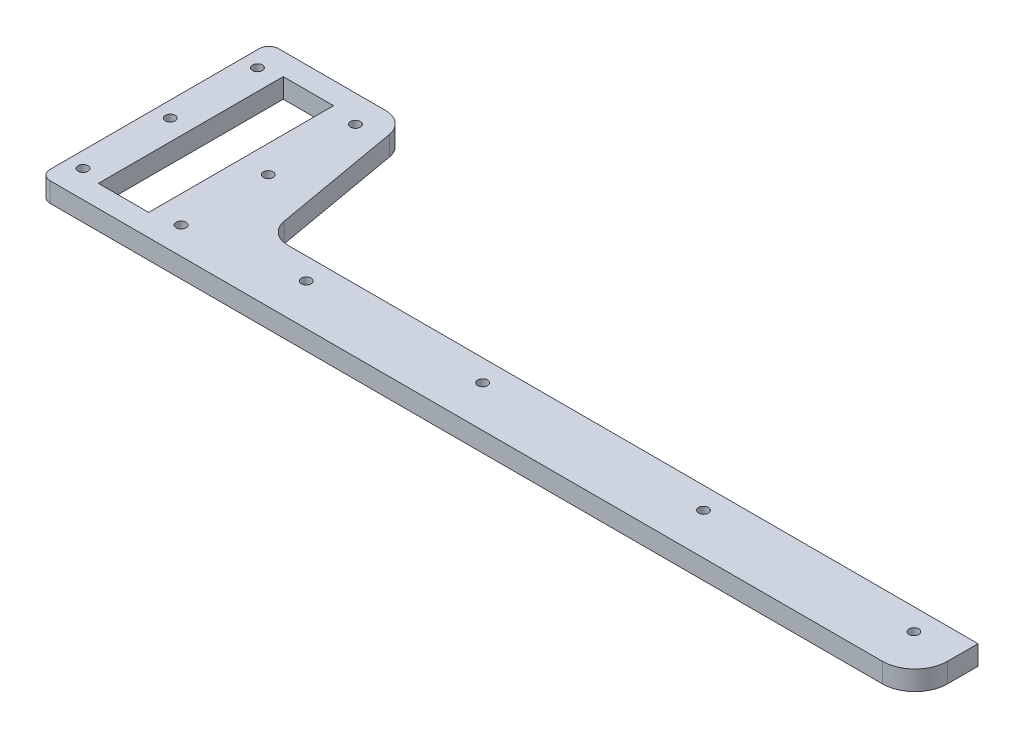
ISO-10303-21;
HEADER;
FILE_DESCRIPTION(('STEP AP214'),'2;1');
FILE_NAME('part.step','',(''),(''),'','','');
FILE_SCHEMA(('AUTOMOTIVE_DESIGN { 1 0 10303 214 1 1 1 1 }'));
ENDSEC;
DATA;
#1=APPLICATION_CONTEXT('core data for automotive mechanical design processes');
#2=APPLICATION_PROTOCOL_DEFINITION('international standard','automotive_design',2000,#1);
#3=PRODUCT_CONTEXT('',#1,'mechanical');
#4=PRODUCT('Part','Part','',(#3));
#5=PRODUCT_RELATED_PRODUCT_CATEGORY('part','',(#4));
#6=PRODUCT_DEFINITION_FORMATION('','',#4);
#7=PRODUCT_DEFINITION_CONTEXT('part definition',#1,'design');
#8=PRODUCT_DEFINITION('design','',#6,#7);
#9=PRODUCT_DEFINITION_SHAPE('','',#8);
#10=(LENGTH_UNIT() NAMED_UNIT(*) SI_UNIT(.MILLI.,.METRE.));
#11=(NAMED_UNIT(*) PLANE_ANGLE_UNIT() SI_UNIT($,.RADIAN.));
#12=(NAMED_UNIT(*) SI_UNIT($,.STERADIAN.) SOLID_ANGLE_UNIT());
#13=UNCERTAINTY_MEASURE_WITH_UNIT(LENGTH_MEASURE(1.E-05),#10,'distance_accuracy_value','');
#14=(GEOMETRIC_REPRESENTATION_CONTEXT(3) GLOBAL_UNCERTAINTY_ASSIGNED_CONTEXT((#13)) GLOBAL_UNIT_ASSIGNED_CONTEXT((#10,
#11,#12)) REPRESENTATION_CONTEXT('',''));
#15=CARTESIAN_POINT('',(0.,0.,0.));
#16=DIRECTION('',(0.,0.,1.));
#17=DIRECTION('',(1.,0.,0.));
#18=AXIS2_PLACEMENT_3D('',#15,#16,#17);
#19=CARTESIAN_POINT('',(0.,3.,0.));
#20=DIRECTION('',(0.,1.,0.));
#21=DIRECTION('',(0.,0.,1.));
#22=AXIS2_PLACEMENT_3D('',#19,#20,#21);
#23=PLANE('',#22);
#24=DIRECTION('',(1.,0.,0.));
#25=VECTOR('',#24,1.);
#26=CARTESIAN_POINT('',(-7.7,3.,12.6));
#27=LINE('',#26,#25);
#28=CARTESIAN_POINT('',(7.7,3.,12.6));
#29=VERTEX_POINT('',#28);
#30=CARTESIAN_POINT('',(-7.7,3.,12.6));
#31=VERTEX_POINT('',#30);
#32=EDGE_CURVE('E339',#29,#31,#27,.F.);
#33=ORIENTED_EDGE('',*,*,#32,.T.);
#34=DIRECTION('',(0.,0.,1.));
#35=VECTOR('',#34,1.);
#36=CARTESIAN_POINT('',(-7.7,3.,-44.));
#37=LINE('',#36,#35);
#38=CARTESIAN_POINT('',(-7.7,3.,-44.));
#39=VERTEX_POINT('',#38);
#40=EDGE_CURVE('E252',#31,#39,#37,.F.);
#41=ORIENTED_EDGE('',*,*,#40,.T.);
#42=DIRECTION('',(-1.,0.,0.));
#43=VECTOR('',#42,1.);
#44=CARTESIAN_POINT('',(7.7,3.,-44.));
#45=LINE('',#44,#43);
#46=CARTESIAN_POINT('',(7.7,3.,-44.));
#47=VERTEX_POINT('',#46);
#48=EDGE_CURVE('E348',#39,#47,#45,.F.);
#49=ORIENTED_EDGE('',*,*,#48,.T.);
#50=DIRECTION('',(0.,0.,-1.));
#51=VECTOR('',#50,1.);
#52=CARTESIAN_POINT('',(7.7,3.,12.6));
#53=LINE('',#52,#51);
#54=EDGE_CURVE('E343',#47,#29,#53,.F.);
#55=ORIENTED_EDGE('',*,*,#54,.T.);
#56=EDGE_LOOP('',(#33,#41,#49,#55));
#57=FACE_BOUND('',#56,.T.);
#58=CARTESIAN_POINT('',(-14.,3.,11.));
#59=DIRECTION('',(0.,1.,0.));
#60=DIRECTION('',(0.,0.,1.));
#61=AXIS2_PLACEMENT_3D('',#58,#59,#60);
#62=CIRCLE('',#61,1.5);
#63=CARTESIAN_POINT('',(-14.,3.,12.5));
#64=VERTEX_POINT('',#63);
#65=EDGE_CURVE('E249',#64,#64,#62,.F.);
#66=ORIENTED_EDGE('',*,*,#65,.T.);
#67=EDGE_LOOP('',(#66));
#68=FACE_BOUND('',#67,.T.);
#69=CARTESIAN_POINT('',(-14.,3.,-15.7));
#70=DIRECTION('',(0.,1.,0.));
#71=DIRECTION('',(0.,0.,1.));
#72=AXIS2_PLACEMENT_3D('',#69,#70,#71);
#73=CIRCLE('',#72,1.5);
#74=CARTESIAN_POINT('',(-14.,3.,-14.2));
#75=VERTEX_POINT('',#74);
#76=EDGE_CURVE('E253',#75,#75,#73,.F.);
#77=ORIENTED_EDGE('',*,*,#76,.T.);
#78=EDGE_LOOP('',(#77));
#79=FACE_BOUND('',#78,.T.);
#80=CARTESIAN_POINT('',(-14.,3.,-42.4));
#81=DIRECTION('',(0.,1.,0.));
#82=DIRECTION('',(0.,0.,1.));
#83=AXIS2_PLACEMENT_3D('',#80,#81,#82);
#84=CIRCLE('',#83,1.5);
#85=CARTESIAN_POINT('',(-14.,3.,-40.9));
#86=VERTEX_POINT('',#85);
#87=EDGE_CURVE('E256',#86,#86,#84,.F.);
#88=ORIENTED_EDGE('',*,*,#87,.T.);
#89=EDGE_LOOP('',(#88));
#90=FACE_BOUND('',#89,.T.);
#91=CARTESIAN_POINT('',(16.,3.,11.));
#92=DIRECTION('',(0.,1.,0.));
#93=DIRECTION('',(0.,0.,1.));
#94=AXIS2_PLACEMENT_3D('',#91,#92,#93);
#95=CIRCLE('',#94,1.5);
#96=CARTESIAN_POINT('',(16.,3.,12.5));
#97=VERTEX_POINT('',#96);
#98=EDGE_CURVE('E259',#97,#97,#95,.F.);
#99=ORIENTED_EDGE('',*,*,#98,.T.);
#100=EDGE_LOOP('',(#99));
#101=FACE_BOUND('',#100,.T.);
#102=CARTESIAN_POINT('',(16.,3.,-15.7));
#103=DIRECTION('',(0.,1.,0.));
#104=DIRECTION('',(0.,0.,1.));
#105=AXIS2_PLACEMENT_3D('',#102,#103,#104);
#106=CIRCLE('',#105,1.5);
#107=CARTESIAN_POINT('',(16.,3.,-14.2));
#108=VERTEX_POINT('',#107);
#109=EDGE_CURVE('E262',#108,#108,#106,.F.);
#110=ORIENTED_EDGE('',*,*,#109,.T.);
#111=EDGE_LOOP('',(#110));
#112=FACE_BOUND('',#111,.T.);
#113=CARTESIAN_POINT('',(16.,3.,-42.4));
#114=DIRECTION('',(0.,1.,0.));
#115=DIRECTION('',(0.,0.,1.));
#116=AXIS2_PLACEMENT_3D('',#113,#114,#115);
#117=CIRCLE('',#116,1.5);
#118=CARTESIAN_POINT('',(16.,3.,-40.9));
#119=VERTEX_POINT('',#118);
#120=EDGE_CURVE('E265',#119,#119,#117,.F.);
#121=ORIENTED_EDGE('',*,*,#120,.T.);
#122=EDGE_LOOP('',(#121));
#123=FACE_BOUND('',#122,.T.);
#124=CARTESIAN_POINT('',(50.,3.,6.65));
#125=DIRECTION('',(0.,1.,0.));
#126=DIRECTION('',(0.,0.,1.));
#127=AXIS2_PLACEMENT_3D('',#124,#125,#126);
#128=CIRCLE('',#127,1.5);
#129=CARTESIAN_POINT('',(50.,3.,8.15));
#130=VERTEX_POINT('',#129);
#131=EDGE_CURVE('E269',#130,#130,#128,.F.);
#132=ORIENTED_EDGE('',*,*,#131,.T.);
#133=EDGE_LOOP('',(#132));
#134=FACE_BOUND('',#133,.T.);
#135=CARTESIAN_POINT('',(104.,3.,6.65));
#136=DIRECTION('',(0.,1.,0.));
#137=DIRECTION('',(0.,0.,1.));
#138=AXIS2_PLACEMENT_3D('',#135,#136,#137);
#139=CIRCLE('',#138,1.5);
#140=CARTESIAN_POINT('',(104.,3.,8.15));
#141=VERTEX_POINT('',#140);
#142=EDGE_CURVE('E273',#141,#141,#139,.F.);
#143=ORIENTED_EDGE('',*,*,#142,.T.);
#144=EDGE_LOOP('',(#143));
#145=FACE_BOUND('',#144,.T.);
#146=CARTESIAN_POINT('',(171.6,3.,6.65));
#147=DIRECTION('',(0.,1.,0.));
#148=DIRECTION('',(0.,0.,1.));
#149=AXIS2_PLACEMENT_3D('',#146,#147,#148);
#150=CIRCLE('',#149,1.5);
#151=CARTESIAN_POINT('',(171.6,3.,8.15));
#152=VERTEX_POINT('',#151);
#153=EDGE_CURVE('E277',#152,#152,#150,.F.);
#154=ORIENTED_EDGE('',*,*,#153,.T.);
#155=EDGE_LOOP('',(#154));
#156=FACE_BOUND('',#155,.T.);
#157=CARTESIAN_POINT('',(236.,3.,6.65));
#158=DIRECTION('',(0.,1.,0.));
#159=DIRECTION('',(0.,0.,1.));
#160=AXIS2_PLACEMENT_3D('',#157,#158,#159);
#161=CIRCLE('',#160,1.5);
#162=CARTESIAN_POINT('',(236.,3.,8.15));
#163=VERTEX_POINT('',#162);
#164=EDGE_CURVE('E165',#163,#163,#161,.F.);
#165=ORIENTED_EDGE('',*,*,#164,.T.);
#166=EDGE_LOOP('',(#165));
#167=FACE_BOUND('',#166,.T.);
#168=DIRECTION('',(-1.,0.,0.));
#169=VECTOR('',#168,1.);
#170=CARTESIAN_POINT('',(249.,3.,0.));
#171=LINE('',#170,#169);
#172=CARTESIAN_POINT('',(37.67369741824,3.,0.));
#173=VERTEX_POINT('',#172);
#174=CARTESIAN_POINT('',(249.,3.,0.));
#175=VERTEX_POINT('',#174);
#176=EDGE_CURVE('E148',#173,#175,#171,.F.);
#177=ORIENTED_EDGE('',*,*,#176,.F.);
#178=CARTESIAN_POINT('',(37.67369741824,3.,-7.));
#179=DIRECTION('',(0.,1.,0.));
#180=DIRECTION('',(0.,0.,1.));
#181=AXIS2_PLACEMENT_3D('',#178,#179,#180);
#182=CIRCLE('',#181,7.);
#183=CARTESIAN_POINT('',(30.7800431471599,3.,-5.7844627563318));
#184=VERTEX_POINT('',#183);
#185=EDGE_CURVE('E20',#173,#184,#182,.F.);
#186=ORIENTED_EDGE('',*,*,#185,.T.);
#187=DIRECTION('',(-0.173648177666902,0.,-0.984807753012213));
#188=VECTOR('',#187,1.);
#189=CARTESIAN_POINT('',(30.78004314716,3.,-5.784462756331));
#190=LINE('',#189,#188);
#191=CARTESIAN_POINT('',(23.880178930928,3.,-44.9155372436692));
#192=VERTEX_POINT('',#191);
#193=EDGE_CURVE('E145',#192,#184,#190,.F.);
#194=ORIENTED_EDGE('',*,*,#193,.F.);
#195=CARTESIAN_POINT('',(16.98652465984,3.,-43.7));
#196=DIRECTION('',(0.,1.,0.));
#197=DIRECTION('',(0.,0.,1.));
#198=AXIS2_PLACEMENT_3D('',#195,#196,#197);
#199=CIRCLE('',#198,7.);
#200=CARTESIAN_POINT('',(16.98652465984,3.,-50.7));
#201=VERTEX_POINT('',#200);
#202=EDGE_CURVE('E290',#201,#192,#199,.F.);
#203=ORIENTED_EDGE('',*,*,#202,.F.);
#204=DIRECTION('',(-1.,0.,0.));
#205=VECTOR('',#204,1.);
#206=CARTESIAN_POINT('',(16.98652465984,3.,-50.7));
#207=LINE('',#206,#205);
#208=CARTESIAN_POINT('',(-15.8,3.,-50.7));
#209=VERTEX_POINT('',#208);
#210=EDGE_CURVE('E182',#209,#201,#207,.F.);
#211=ORIENTED_EDGE('',*,*,#210,.F.);
#212=CARTESIAN_POINT('',(-15.8,3.,-47.7));
#213=DIRECTION('',(0.,1.,0.));
#214=DIRECTION('',(0.,0.,1.));
#215=AXIS2_PLACEMENT_3D('',#212,#213,#214);
#216=CIRCLE('',#215,3.);
#217=CARTESIAN_POINT('',(-18.8,3.,-47.7));
#218=VERTEX_POINT('',#217);
#219=EDGE_CURVE('E289',#218,#209,#216,.F.);
#220=ORIENTED_EDGE('',*,*,#219,.F.);
#221=DIRECTION('',(0.,0.,1.));
#222=VECTOR('',#221,1.);
#223=CARTESIAN_POINT('',(-18.8,3.,-47.7));
#224=LINE('',#223,#222);
#225=CARTESIAN_POINT('',(-18.8,3.,16.3));
#226=VERTEX_POINT('',#225);
#227=EDGE_CURVE('E178',#226,#218,#224,.F.);
#228=ORIENTED_EDGE('',*,*,#227,.F.);
#229=CARTESIAN_POINT('',(-15.8,3.,16.3));
#230=DIRECTION('',(0.,1.,0.));
#231=DIRECTION('',(0.,0.,1.));
#232=AXIS2_PLACEMENT_3D('',#229,#230,#231);
#233=CIRCLE('',#232,3.);
#234=CARTESIAN_POINT('',(-15.8,3.,19.3));
#235=VERTEX_POINT('',#234);
#236=EDGE_CURVE('E287',#235,#226,#233,.F.);
#237=ORIENTED_EDGE('',*,*,#236,.F.);
#238=DIRECTION('',(1.,0.,0.));
#239=VECTOR('',#238,1.);
#240=CARTESIAN_POINT('',(-15.8,3.,19.3));
#241=LINE('',#240,#239);
#242=CARTESIAN_POINT('',(239.,3.,19.3));
#243=VERTEX_POINT('',#242);
#244=EDGE_CURVE('E173',#243,#235,#241,.F.);
#245=ORIENTED_EDGE('',*,*,#244,.F.);
#246=CARTESIAN_POINT('',(239.,3.,9.3));
#247=DIRECTION('',(0.,1.,0.));
#248=DIRECTION('',(0.,0.,1.));
#249=AXIS2_PLACEMENT_3D('',#246,#247,#248);
#250=CIRCLE('',#249,10.);
#251=CARTESIAN_POINT('',(249.,3.,9.3));
#252=VERTEX_POINT('',#251);
#253=EDGE_CURVE('E283',#252,#243,#250,.F.);
#254=ORIENTED_EDGE('',*,*,#253,.F.);
#255=DIRECTION('',(0.,0.,-1.));
#256=VECTOR('',#255,1.);
#257=CARTESIAN_POINT('',(249.,3.,9.3));
#258=LINE('',#257,#256);
#259=EDGE_CURVE('E156',#175,#252,#258,.F.);
#260=ORIENTED_EDGE('',*,*,#259,.F.);
#261=EDGE_LOOP('',(#177,#186,#194,#203,#211,#220,#228,#237,#245,#254,#260));
#262=FACE_BOUND('',#261,.T.);
#263=ADVANCED_FACE('F17',(#57,#68,#79,#90,#101,#112,#123,#134,#145,#156,#167,#262),#23,.T.);
#264=CARTESIAN_POINT('',(37.67369741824,-3.,-7.));
#265=DIRECTION('',(0.,1.,0.));
#266=DIRECTION('',(0.,0.,1.));
#267=AXIS2_PLACEMENT_3D('',#264,#265,#266);
#268=CYLINDRICAL_SURFACE('',#267,7.);
#269=ORIENTED_EDGE('',*,*,#185,.F.);
#270=DIRECTION('',(0.,1.,0.));
#271=VECTOR('',#270,1.);
#272=CARTESIAN_POINT('',(37.67369741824,-3.,0.));
#273=LINE('',#272,#271);
#274=CARTESIAN_POINT('',(37.67369741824,-3.,0.));
#275=VERTEX_POINT('',#274);
#276=EDGE_CURVE('E138',#275,#173,#273,.T.);
#277=ORIENTED_EDGE('',*,*,#276,.F.);
#278=CARTESIAN_POINT('',(37.67369741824,-3.,-7.));
#279=DIRECTION('',(0.,1.,0.));
#280=DIRECTION('',(0.,0.,1.));
#281=AXIS2_PLACEMENT_3D('',#278,#279,#280);
#282=CIRCLE('',#281,7.);
#283=CARTESIAN_POINT('',(30.7800431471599,-3.,-5.78446275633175));
#284=VERTEX_POINT('',#283);
#285=EDGE_CURVE('E245',#275,#284,#282,.F.);
#286=ORIENTED_EDGE('',*,*,#285,.T.);
#287=DIRECTION('',(0.,1.,0.));
#288=VECTOR('',#287,1.);
#289=CARTESIAN_POINT('',(30.78004314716,-3.,-5.784462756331));
#290=LINE('',#289,#288);
#291=EDGE_CURVE('E140',#184,#284,#290,.F.);
#292=ORIENTED_EDGE('',*,*,#291,.F.);
#293=EDGE_LOOP('',(#269,#277,#286,#292));
#294=FACE_BOUND('',#293,.T.);
#295=ADVANCED_FACE('F136',(#294),#268,.F.);
#296=CARTESIAN_POINT('',(30.78004314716,-3.,-5.784462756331));
#297=DIRECTION('',(0.984807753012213,0.,-0.173648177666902));
#298=DIRECTION('',(-0.173648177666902,0.,-0.984807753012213));
#299=AXIS2_PLACEMENT_3D('',#296,#297,#298);
#300=PLANE('',#299);
#301=ORIENTED_EDGE('',*,*,#291,.T.);
#302=DIRECTION('',(-0.173648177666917,0.,-0.98480775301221));
#303=VECTOR('',#302,1.);
#304=CARTESIAN_POINT('',(30.78004314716,-3.,-5.784462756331));
#305=LINE('',#304,#303);
#306=CARTESIAN_POINT('',(23.8801789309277,-3.,-44.9155372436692));
#307=VERTEX_POINT('',#306);
#308=EDGE_CURVE('E244',#284,#307,#305,.T.);
#309=ORIENTED_EDGE('',*,*,#308,.T.);
#310=DIRECTION('',(0.,1.,0.));
#311=VECTOR('',#310,1.);
#312=CARTESIAN_POINT('',(23.8801789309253,-3.,-44.9155372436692));
#313=LINE('',#312,#311);
#314=EDGE_CURVE('E186',#192,#307,#313,.F.);
#315=ORIENTED_EDGE('',*,*,#314,.F.);
#316=ORIENTED_EDGE('',*,*,#193,.T.);
#317=EDGE_LOOP('',(#301,#309,#315,#316));
#318=FACE_BOUND('',#317,.T.);
#319=ADVANCED_FACE('F333',(#318),#300,.T.);
#320=CARTESIAN_POINT('',(16.98652465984,-3.,-43.7));
#321=DIRECTION('',(0.,1.,0.));
#322=DIRECTION('',(0.,0.,1.));
#323=AXIS2_PLACEMENT_3D('',#320,#321,#322);
#324=CYLINDRICAL_SURFACE('',#323,7.);
#325=ORIENTED_EDGE('',*,*,#314,.T.);
#326=CARTESIAN_POINT('',(16.98652465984,-3.,-43.7));
#327=DIRECTION('',(0.,1.,0.));
#328=DIRECTION('',(0.,0.,1.));
#329=AXIS2_PLACEMENT_3D('',#326,#327,#328);
#330=CIRCLE('',#329,7.);
#331=CARTESIAN_POINT('',(16.98652465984,-3.,-50.7));
#332=VERTEX_POINT('',#331);
#333=EDGE_CURVE('E240',#307,#332,#330,.T.);
#334=ORIENTED_EDGE('',*,*,#333,.T.);
#335=DIRECTION('',(0.,1.,0.));
#336=VECTOR('',#335,1.);
#337=CARTESIAN_POINT('',(16.98652465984,-3.,-50.7));
#338=LINE('',#337,#336);
#339=EDGE_CURVE('E185',#201,#332,#338,.F.);
#340=ORIENTED_EDGE('',*,*,#339,.F.);
#341=ORIENTED_EDGE('',*,*,#202,.T.);
#342=EDGE_LOOP('',(#325,#334,#340,#341));
#343=FACE_BOUND('',#342,.T.);
#344=ADVANCED_FACE('F331',(#343),#324,.T.);
#345=CARTESIAN_POINT('',(16.98652465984,-3.,-50.7));
#346=DIRECTION('',(0.,0.,-1.));
#347=DIRECTION('',(-1.,0.,0.));
#348=AXIS2_PLACEMENT_3D('',#345,#346,#347);
#349=PLANE('',#348);
#350=ORIENTED_EDGE('',*,*,#339,.T.);
#351=DIRECTION('',(1.,0.,0.));
#352=VECTOR('',#351,1.);
#353=CARTESIAN_POINT('',(0.,-3.,-50.7));
#354=LINE('',#353,#352);
#355=CARTESIAN_POINT('',(-15.8,-3.,-50.7));
#356=VERTEX_POINT('',#355);
#357=EDGE_CURVE('E239',#332,#356,#354,.F.);
#358=ORIENTED_EDGE('',*,*,#357,.T.);
#359=DIRECTION('',(0.,1.,0.));
#360=VECTOR('',#359,1.);
#361=CARTESIAN_POINT('',(-15.8,-3.,-50.7));
#362=LINE('',#361,#360);
#363=EDGE_CURVE('E181',#209,#356,#362,.F.);
#364=ORIENTED_EDGE('',*,*,#363,.F.);
#365=ORIENTED_EDGE('',*,*,#210,.T.);
#366=EDGE_LOOP('',(#350,#358,#364,#365));
#367=FACE_BOUND('',#366,.T.);
#368=ADVANCED_FACE('F321',(#367),#349,.T.);
#369=CARTESIAN_POINT('',(-15.8,-3.,-47.7));
#370=DIRECTION('',(0.,1.,0.));
#371=DIRECTION('',(0.,0.,1.));
#372=AXIS2_PLACEMENT_3D('',#369,#370,#371);
#373=CYLINDRICAL_SURFACE('',#372,3.);
#374=ORIENTED_EDGE('',*,*,#363,.T.);
#375=CARTESIAN_POINT('',(-15.8,-3.,-47.7));
#376=DIRECTION('',(0.,1.,0.));
#377=DIRECTION('',(0.,0.,1.));
#378=AXIS2_PLACEMENT_3D('',#375,#376,#377);
#379=CIRCLE('',#378,3.);
#380=CARTESIAN_POINT('',(-18.8,-3.,-47.7));
#381=VERTEX_POINT('',#380);
#382=EDGE_CURVE('E236',#356,#381,#379,.T.);
#383=ORIENTED_EDGE('',*,*,#382,.T.);
#384=DIRECTION('',(0.,1.,0.));
#385=VECTOR('',#384,1.);
#386=CARTESIAN_POINT('',(-18.8,-3.,-47.7));
#387=LINE('',#386,#385);
#388=EDGE_CURVE('E180',#218,#381,#387,.F.);
#389=ORIENTED_EDGE('',*,*,#388,.F.);
#390=ORIENTED_EDGE('',*,*,#219,.T.);
#391=EDGE_LOOP('',(#374,#383,#389,#390));
#392=FACE_BOUND('',#391,.T.);
#393=ADVANCED_FACE('F390',(#392),#373,.T.);
#394=CARTESIAN_POINT('',(-18.8,-3.,-47.7));
#395=DIRECTION('',(-1.,0.,0.));
#396=DIRECTION('',(0.,0.,1.));
#397=AXIS2_PLACEMENT_3D('',#394,#395,#396);
#398=PLANE('',#397);
#399=ORIENTED_EDGE('',*,*,#388,.T.);
#400=DIRECTION('',(0.,0.,1.));
#401=VECTOR('',#400,1.);
#402=CARTESIAN_POINT('',(-18.8,-3.,0.));
#403=LINE('',#402,#401);
#404=CARTESIAN_POINT('',(-18.8,-3.,16.3));
#405=VERTEX_POINT('',#404);
#406=EDGE_CURVE('E235',#381,#405,#403,.T.);
#407=ORIENTED_EDGE('',*,*,#406,.T.);
#408=DIRECTION('',(0.,1.,0.));
#409=VECTOR('',#408,1.);
#410=CARTESIAN_POINT('',(-18.8,-3.,16.3));
#411=LINE('',#410,#409);
#412=EDGE_CURVE('E177',#226,#405,#411,.F.);
#413=ORIENTED_EDGE('',*,*,#412,.F.);
#414=ORIENTED_EDGE('',*,*,#227,.T.);
#415=EDGE_LOOP('',(#399,#407,#413,#414));
#416=FACE_BOUND('',#415,.T.);
#417=ADVANCED_FACE('F385',(#416),#398,.T.);
#418=CARTESIAN_POINT('',(-15.8,-3.,16.3));
#419=DIRECTION('',(0.,1.,0.));
#420=DIRECTION('',(0.,0.,1.));
#421=AXIS2_PLACEMENT_3D('',#418,#419,#420);
#422=CYLINDRICAL_SURFACE('',#421,3.);
#423=ORIENTED_EDGE('',*,*,#412,.T.);
#424=CARTESIAN_POINT('',(-15.8,-3.,16.3));
#425=DIRECTION('',(0.,1.,0.));
#426=DIRECTION('',(0.,0.,1.));
#427=AXIS2_PLACEMENT_3D('',#424,#425,#426);
#428=CIRCLE('',#427,3.);
#429=CARTESIAN_POINT('',(-15.8,-3.,19.3));
#430=VERTEX_POINT('',#429);
#431=EDGE_CURVE('E232',#405,#430,#428,.T.);
#432=ORIENTED_EDGE('',*,*,#431,.T.);
#433=DIRECTION('',(0.,1.,0.));
#434=VECTOR('',#433,1.);
#435=CARTESIAN_POINT('',(-15.8,-3.,19.3));
#436=LINE('',#435,#434);
#437=EDGE_CURVE('E176',#235,#430,#436,.F.);
#438=ORIENTED_EDGE('',*,*,#437,.F.);
#439=ORIENTED_EDGE('',*,*,#236,.T.);
#440=EDGE_LOOP('',(#423,#432,#438,#439));
#441=FACE_BOUND('',#440,.T.);
#442=ADVANCED_FACE('F397',(#441),#422,.T.);
#443=CARTESIAN_POINT('',(-15.8,-3.,19.3));
#444=DIRECTION('',(0.,0.,1.));
#445=DIRECTION('',(1.,0.,0.));
#446=AXIS2_PLACEMENT_3D('',#443,#444,#445);
#447=PLANE('',#446);
#448=ORIENTED_EDGE('',*,*,#437,.T.);
#449=DIRECTION('',(1.,0.,0.));
#450=VECTOR('',#449,1.);
#451=CARTESIAN_POINT('',(0.,-3.,19.3));
#452=LINE('',#451,#450);
#453=CARTESIAN_POINT('',(239.,-3.,19.3));
#454=VERTEX_POINT('',#453);
#455=EDGE_CURVE('E231',#430,#454,#452,.T.);
#456=ORIENTED_EDGE('',*,*,#455,.T.);
#457=DIRECTION('',(0.,1.,0.));
#458=VECTOR('',#457,1.);
#459=CARTESIAN_POINT('',(239.,-3.,19.3));
#460=LINE('',#459,#458);
#461=EDGE_CURVE('E286',#243,#454,#460,.F.);
#462=ORIENTED_EDGE('',*,*,#461,.F.);
#463=ORIENTED_EDGE('',*,*,#244,.T.);
#464=EDGE_LOOP('',(#448,#456,#462,#463));
#465=FACE_BOUND('',#464,.T.);
#466=ADVANCED_FACE('F399',(#465),#447,.T.);
#467=CARTESIAN_POINT('',(239.,-3.,9.3));
#468=DIRECTION('',(0.,1.,0.));
#469=DIRECTION('',(0.,0.,1.));
#470=AXIS2_PLACEMENT_3D('',#467,#468,#469);
#471=CYLINDRICAL_SURFACE('',#470,10.);
#472=ORIENTED_EDGE('',*,*,#461,.T.);
#473=CARTESIAN_POINT('',(239.,-3.,9.3));
#474=DIRECTION('',(0.,1.,0.));
#475=DIRECTION('',(0.,0.,1.));
#476=AXIS2_PLACEMENT_3D('',#473,#474,#475);
#477=CIRCLE('',#476,10.);
#478=CARTESIAN_POINT('',(249.,-3.,9.3));
#479=VERTEX_POINT('',#478);
#480=EDGE_CURVE('E226',#454,#479,#477,.T.);
#481=ORIENTED_EDGE('',*,*,#480,.T.);
#482=DIRECTION('',(0.,1.,0.));
#483=VECTOR('',#482,1.);
#484=CARTESIAN_POINT('',(249.,-3.,9.3));
#485=LINE('',#484,#483);
#486=EDGE_CURVE('E153',#252,#479,#485,.F.);
#487=ORIENTED_EDGE('',*,*,#486,.F.);
#488=ORIENTED_EDGE('',*,*,#253,.T.);
#489=EDGE_LOOP('',(#472,#481,#487,#488));
#490=FACE_BOUND('',#489,.T.);
#491=ADVANCED_FACE('F401',(#490),#471,.T.);
#492=CARTESIAN_POINT('',(249.,-3.,9.3));
#493=DIRECTION('',(1.,0.,0.));
#494=DIRECTION('',(0.,0.,-1.));
#495=AXIS2_PLACEMENT_3D('',#492,#493,#494);
#496=PLANE('',#495);
#497=ORIENTED_EDGE('',*,*,#486,.T.);
#498=DIRECTION('',(0.,0.,1.));
#499=VECTOR('',#498,1.);
#500=CARTESIAN_POINT('',(249.,-3.,0.));
#501=LINE('',#500,#499);
#502=CARTESIAN_POINT('',(249.,-3.,0.));
#503=VERTEX_POINT('',#502);
#504=EDGE_CURVE('E230',#479,#503,#501,.F.);
#505=ORIENTED_EDGE('',*,*,#504,.T.);
#506=DIRECTION('',(0.,1.,0.));
#507=VECTOR('',#506,1.);
#508=CARTESIAN_POINT('',(249.,-3.,0.));
#509=LINE('',#508,#507);
#510=EDGE_CURVE('E159',#175,#503,#509,.F.);
#511=ORIENTED_EDGE('',*,*,#510,.F.);
#512=ORIENTED_EDGE('',*,*,#259,.T.);
#513=EDGE_LOOP('',(#497,#505,#511,#512));
#514=FACE_BOUND('',#513,.T.);
#515=ADVANCED_FACE('F402',(#514),#496,.T.);
#516=CARTESIAN_POINT('',(249.,-3.,0.));
#517=DIRECTION('',(0.,0.,-1.));
#518=DIRECTION('',(-1.,0.,0.));
#519=AXIS2_PLACEMENT_3D('',#516,#517,#518);
#520=PLANE('',#519);
#521=ORIENTED_EDGE('',*,*,#510,.T.);
#522=DIRECTION('',(1.,0.,0.));
#523=VECTOR('',#522,1.);
#524=CARTESIAN_POINT('',(0.,-3.,0.));
#525=LINE('',#524,#523);
#526=EDGE_CURVE('E151',#503,#275,#525,.F.);
#527=ORIENTED_EDGE('',*,*,#526,.T.);
#528=ORIENTED_EDGE('',*,*,#276,.T.);
#529=ORIENTED_EDGE('',*,*,#176,.T.);
#530=EDGE_LOOP('',(#521,#527,#528,#529));
#531=FACE_BOUND('',#530,.T.);
#532=ADVANCED_FACE('F147',(#531),#520,.T.);
#533=CARTESIAN_POINT('',(236.,-3.,6.65));
#534=DIRECTION('',(0.,1.,0.));
#535=DIRECTION('',(0.,0.,1.));
#536=AXIS2_PLACEMENT_3D('',#533,#534,#535);
#537=CYLINDRICAL_SURFACE('',#536,1.5);
#538=ORIENTED_EDGE('',*,*,#164,.F.);
#539=EDGE_LOOP('',(#538));
#540=FACE_BOUND('',#539,.T.);
#541=CARTESIAN_POINT('',(236.,-3.,6.65));
#542=DIRECTION('',(0.,1.,0.));
#543=DIRECTION('',(0.,0.,1.));
#544=AXIS2_PLACEMENT_3D('',#541,#542,#543);
#545=CIRCLE('',#544,1.5);
#546=CARTESIAN_POINT('',(236.,-3.,8.15));
#547=VERTEX_POINT('',#546);
#548=EDGE_CURVE('E222',#547,#547,#545,.F.);
#549=ORIENTED_EDGE('',*,*,#548,.T.);
#550=EDGE_LOOP('',(#549));
#551=FACE_BOUND('',#550,.T.);
#552=ADVANCED_FACE('F411',(#540,#551),#537,.F.);
#553=CARTESIAN_POINT('',(171.6,-3.,6.65));
#554=DIRECTION('',(0.,1.,0.));
#555=DIRECTION('',(0.,0.,1.));
#556=AXIS2_PLACEMENT_3D('',#553,#554,#555);
#557=CYLINDRICAL_SURFACE('',#556,1.5);
#558=ORIENTED_EDGE('',*,*,#153,.F.);
#559=EDGE_LOOP('',(#558));
#560=FACE_BOUND('',#559,.T.);
#561=CARTESIAN_POINT('',(171.6,-3.,6.65));
#562=DIRECTION('',(0.,1.,0.));
#563=DIRECTION('',(0.,0.,1.));
#564=AXIS2_PLACEMENT_3D('',#561,#562,#563);
#565=CIRCLE('',#564,1.5);
#566=CARTESIAN_POINT('',(171.6,-3.,8.15));
#567=VERTEX_POINT('',#566);
#568=EDGE_CURVE('E218',#567,#567,#565,.F.);
#569=ORIENTED_EDGE('',*,*,#568,.T.);
#570=EDGE_LOOP('',(#569));
#571=FACE_BOUND('',#570,.T.);
#572=ADVANCED_FACE('F464',(#560,#571),#557,.F.);
#573=CARTESIAN_POINT('',(104.,-3.,6.65));
#574=DIRECTION('',(0.,1.,0.));
#575=DIRECTION('',(0.,0.,1.));
#576=AXIS2_PLACEMENT_3D('',#573,#574,#575);
#577=CYLINDRICAL_SURFACE('',#576,1.5);
#578=ORIENTED_EDGE('',*,*,#142,.F.);
#579=EDGE_LOOP('',(#578));
#580=FACE_BOUND('',#579,.T.);
#581=CARTESIAN_POINT('',(104.,-3.,6.65));
#582=DIRECTION('',(0.,1.,0.));
#583=DIRECTION('',(0.,0.,1.));
#584=AXIS2_PLACEMENT_3D('',#581,#582,#583);
#585=CIRCLE('',#584,1.5);
#586=CARTESIAN_POINT('',(104.,-3.,8.15));
#587=VERTEX_POINT('',#586);
#588=EDGE_CURVE('E214',#587,#587,#585,.F.);
#589=ORIENTED_EDGE('',*,*,#588,.T.);
#590=EDGE_LOOP('',(#589));
#591=FACE_BOUND('',#590,.T.);
#592=ADVANCED_FACE('F460',(#580,#591),#577,.F.);
#593=CARTESIAN_POINT('',(50.,-3.,6.65));
#594=DIRECTION('',(0.,1.,0.));
#595=DIRECTION('',(0.,0.,1.));
#596=AXIS2_PLACEMENT_3D('',#593,#594,#595);
#597=CYLINDRICAL_SURFACE('',#596,1.5);
#598=ORIENTED_EDGE('',*,*,#131,.F.);
#599=EDGE_LOOP('',(#598));
#600=FACE_BOUND('',#599,.T.);
#601=CARTESIAN_POINT('',(50.,-3.,6.65));
#602=DIRECTION('',(0.,1.,0.));
#603=DIRECTION('',(0.,0.,1.));
#604=AXIS2_PLACEMENT_3D('',#601,#602,#603);
#605=CIRCLE('',#604,1.5);
#606=CARTESIAN_POINT('',(50.,-3.,8.15));
#607=VERTEX_POINT('',#606);
#608=EDGE_CURVE('E210',#607,#607,#605,.F.);
#609=ORIENTED_EDGE('',*,*,#608,.T.);
#610=EDGE_LOOP('',(#609));
#611=FACE_BOUND('',#610,.T.);
#612=ADVANCED_FACE('F456',(#600,#611),#597,.F.);
#613=CARTESIAN_POINT('',(16.,-3.,-42.4));
#614=DIRECTION('',(0.,1.,0.));
#615=DIRECTION('',(0.,0.,1.));
#616=AXIS2_PLACEMENT_3D('',#613,#614,#615);
#617=CYLINDRICAL_SURFACE('',#616,1.5);
#618=ORIENTED_EDGE('',*,*,#120,.F.);
#619=EDGE_LOOP('',(#618));
#620=FACE_BOUND('',#619,.T.);
#621=CARTESIAN_POINT('',(16.,-3.,-42.4));
#622=DIRECTION('',(0.,1.,0.));
#623=DIRECTION('',(0.,0.,1.));
#624=AXIS2_PLACEMENT_3D('',#621,#622,#623);
#625=CIRCLE('',#624,1.5);
#626=CARTESIAN_POINT('',(16.,-3.,-40.9));
#627=VERTEX_POINT('',#626);
#628=EDGE_CURVE('E206',#627,#627,#625,.F.);
#629=ORIENTED_EDGE('',*,*,#628,.T.);
#630=EDGE_LOOP('',(#629));
#631=FACE_BOUND('',#630,.T.);
#632=ADVANCED_FACE('F452',(#620,#631),#617,.F.);
#633=CARTESIAN_POINT('',(16.,-3.,-15.7));
#634=DIRECTION('',(0.,1.,0.));
#635=DIRECTION('',(0.,0.,1.));
#636=AXIS2_PLACEMENT_3D('',#633,#634,#635);
#637=CYLINDRICAL_SURFACE('',#636,1.5);
#638=ORIENTED_EDGE('',*,*,#109,.F.);
#639=EDGE_LOOP('',(#638));
#640=FACE_BOUND('',#639,.T.);
#641=CARTESIAN_POINT('',(16.,-3.,-15.7));
#642=DIRECTION('',(0.,1.,0.));
#643=DIRECTION('',(0.,0.,1.));
#644=AXIS2_PLACEMENT_3D('',#641,#642,#643);
#645=CIRCLE('',#644,1.5);
#646=CARTESIAN_POINT('',(16.,-3.,-14.2));
#647=VERTEX_POINT('',#646);
#648=EDGE_CURVE('E203',#647,#647,#645,.F.);
#649=ORIENTED_EDGE('',*,*,#648,.T.);
#650=EDGE_LOOP('',(#649));
#651=FACE_BOUND('',#650,.T.);
#652=ADVANCED_FACE('F448',(#640,#651),#637,.F.);
#653=CARTESIAN_POINT('',(16.,-3.,11.));
#654=DIRECTION('',(0.,1.,0.));
#655=DIRECTION('',(0.,0.,1.));
#656=AXIS2_PLACEMENT_3D('',#653,#654,#655);
#657=CYLINDRICAL_SURFACE('',#656,1.5);
#658=ORIENTED_EDGE('',*,*,#98,.F.);
#659=EDGE_LOOP('',(#658));
#660=FACE_BOUND('',#659,.T.);
#661=CARTESIAN_POINT('',(16.,-3.,11.));
#662=DIRECTION('',(0.,1.,0.));
#663=DIRECTION('',(0.,0.,1.));
#664=AXIS2_PLACEMENT_3D('',#661,#662,#663);
#665=CIRCLE('',#664,1.5);
#666=CARTESIAN_POINT('',(16.,-3.,12.5));
#667=VERTEX_POINT('',#666);
#668=EDGE_CURVE('E200',#667,#667,#665,.F.);
#669=ORIENTED_EDGE('',*,*,#668,.T.);
#670=EDGE_LOOP('',(#669));
#671=FACE_BOUND('',#670,.T.);
#672=ADVANCED_FACE('F444',(#660,#671),#657,.F.);
#673=CARTESIAN_POINT('',(-14.,3.,-42.4));
#674=DIRECTION('',(0.,1.,0.));
#675=DIRECTION('',(0.,0.,1.));
#676=AXIS2_PLACEMENT_3D('',#673,#674,#675);
#677=CYLINDRICAL_SURFACE('',#676,1.5);
#678=ORIENTED_EDGE('',*,*,#87,.F.);
#679=EDGE_LOOP('',(#678));
#680=FACE_BOUND('',#679,.T.);
#681=CARTESIAN_POINT('',(-14.,-3.,-42.4));
#682=DIRECTION('',(0.,1.,0.));
#683=DIRECTION('',(0.,0.,1.));
#684=AXIS2_PLACEMENT_3D('',#681,#682,#683);
#685=CIRCLE('',#684,1.5);
#686=CARTESIAN_POINT('',(-14.,-3.,-40.9));
#687=VERTEX_POINT('',#686);
#688=EDGE_CURVE('E197',#687,#687,#685,.F.);
#689=ORIENTED_EDGE('',*,*,#688,.T.);
#690=EDGE_LOOP('',(#689));
#691=FACE_BOUND('',#690,.T.);
#692=ADVANCED_FACE('F440',(#680,#691),#677,.F.);
#693=CARTESIAN_POINT('',(-14.,3.,-15.7));
#694=DIRECTION('',(0.,1.,0.));
#695=DIRECTION('',(0.,0.,1.));
#696=AXIS2_PLACEMENT_3D('',#693,#694,#695);
#697=CYLINDRICAL_SURFACE('',#696,1.5);
#698=ORIENTED_EDGE('',*,*,#76,.F.);
#699=EDGE_LOOP('',(#698));
#700=FACE_BOUND('',#699,.T.);
#701=CARTESIAN_POINT('',(-14.,-3.,-15.7));
#702=DIRECTION('',(0.,1.,0.));
#703=DIRECTION('',(0.,0.,1.));
#704=AXIS2_PLACEMENT_3D('',#701,#702,#703);
#705=CIRCLE('',#704,1.5);
#706=CARTESIAN_POINT('',(-14.,-3.,-14.2));
#707=VERTEX_POINT('',#706);
#708=EDGE_CURVE('E194',#707,#707,#705,.F.);
#709=ORIENTED_EDGE('',*,*,#708,.T.);
#710=EDGE_LOOP('',(#709));
#711=FACE_BOUND('',#710,.T.);
#712=ADVANCED_FACE('F436',(#700,#711),#697,.F.);
#713=CARTESIAN_POINT('',(-14.,3.,11.));
#714=DIRECTION('',(0.,1.,0.));
#715=DIRECTION('',(0.,0.,1.));
#716=AXIS2_PLACEMENT_3D('',#713,#714,#715);
#717=CYLINDRICAL_SURFACE('',#716,1.5);
#718=ORIENTED_EDGE('',*,*,#65,.F.);
#719=EDGE_LOOP('',(#718));
#720=FACE_BOUND('',#719,.T.);
#721=CARTESIAN_POINT('',(-14.,-3.,11.));
#722=DIRECTION('',(0.,1.,0.));
#723=DIRECTION('',(0.,0.,1.));
#724=AXIS2_PLACEMENT_3D('',#721,#722,#723);
#725=CIRCLE('',#724,1.5);
#726=CARTESIAN_POINT('',(-14.,-3.,12.5));
#727=VERTEX_POINT('',#726);
#728=EDGE_CURVE('E190',#727,#727,#725,.F.);
#729=ORIENTED_EDGE('',*,*,#728,.T.);
#730=EDGE_LOOP('',(#729));
#731=FACE_BOUND('',#730,.T.);
#732=ADVANCED_FACE('F433',(#720,#731),#717,.F.);
#733=CARTESIAN_POINT('',(-7.7,3.,-44.));
#734=DIRECTION('',(-1.,0.,0.));
#735=DIRECTION('',(0.,0.,1.));
#736=AXIS2_PLACEMENT_3D('',#733,#734,#735);
#737=PLANE('',#736);
#738=ORIENTED_EDGE('',*,*,#40,.F.);
#739=DIRECTION('',(0.,1.,0.));
#740=VECTOR('',#739,1.);
#741=CARTESIAN_POINT('',(-7.7,3.,12.6));
#742=LINE('',#741,#740);
#743=CARTESIAN_POINT('',(-7.7,-3.,12.6));
#744=VERTEX_POINT('',#743);
#745=EDGE_CURVE('E248',#31,#744,#742,.F.);
#746=ORIENTED_EDGE('',*,*,#745,.T.);
#747=DIRECTION('',(0.,0.,1.));
#748=VECTOR('',#747,1.);
#749=CARTESIAN_POINT('',(-7.7,-3.,0.));
#750=LINE('',#749,#748);
#751=CARTESIAN_POINT('',(-7.7,-3.,-44.));
#752=VERTEX_POINT('',#751);
#753=EDGE_CURVE('E193',#744,#752,#750,.F.);
#754=ORIENTED_EDGE('',*,*,#753,.T.);
#755=DIRECTION('',(0.,1.,0.));
#756=VECTOR('',#755,1.);
#757=CARTESIAN_POINT('',(-7.7,3.,-44.));
#758=LINE('',#757,#756);
#759=EDGE_CURVE('E350',#752,#39,#758,.T.);
#760=ORIENTED_EDGE('',*,*,#759,.T.);
#761=EDGE_LOOP('',(#738,#746,#754,#760));
#762=FACE_BOUND('',#761,.T.);
#763=ADVANCED_FACE('F365',(#762),#737,.F.);
#764=CARTESIAN_POINT('',(7.7,3.,-44.));
#765=DIRECTION('',(0.,0.,-1.));
#766=DIRECTION('',(-1.,0.,0.));
#767=AXIS2_PLACEMENT_3D('',#764,#765,#766);
#768=PLANE('',#767);
#769=ORIENTED_EDGE('',*,*,#48,.F.);
#770=ORIENTED_EDGE('',*,*,#759,.F.);
#771=DIRECTION('',(1.,0.,0.));
#772=VECTOR('',#771,1.);
#773=CARTESIAN_POINT('',(0.,-3.,-44.));
#774=LINE('',#773,#772);
#775=CARTESIAN_POINT('',(7.7,-3.,-44.));
#776=VERTEX_POINT('',#775);
#777=EDGE_CURVE('E367',#752,#776,#774,.T.);
#778=ORIENTED_EDGE('',*,*,#777,.T.);
#779=DIRECTION('',(0.,1.,0.));
#780=VECTOR('',#779,1.);
#781=CARTESIAN_POINT('',(7.7,3.,-44.));
#782=LINE('',#781,#780);
#783=EDGE_CURVE('E345',#776,#47,#782,.T.);
#784=ORIENTED_EDGE('',*,*,#783,.T.);
#785=EDGE_LOOP('',(#769,#770,#778,#784));
#786=FACE_BOUND('',#785,.T.);
#787=ADVANCED_FACE('F361',(#786),#768,.F.);
#788=CARTESIAN_POINT('',(7.7,3.,12.6));
#789=DIRECTION('',(1.,0.,0.));
#790=DIRECTION('',(0.,0.,-1.));
#791=AXIS2_PLACEMENT_3D('',#788,#789,#790);
#792=PLANE('',#791);
#793=ORIENTED_EDGE('',*,*,#54,.F.);
#794=ORIENTED_EDGE('',*,*,#783,.F.);
#795=DIRECTION('',(0.,0.,1.));
#796=VECTOR('',#795,1.);
#797=CARTESIAN_POINT('',(7.7,-3.,0.));
#798=LINE('',#797,#796);
#799=CARTESIAN_POINT('',(7.7,-3.,12.6));
#800=VERTEX_POINT('',#799);
#801=EDGE_CURVE('E26',#776,#800,#798,.T.);
#802=ORIENTED_EDGE('',*,*,#801,.T.);
#803=DIRECTION('',(0.,1.,0.));
#804=VECTOR('',#803,1.);
#805=CARTESIAN_POINT('',(7.7,3.,12.6));
#806=LINE('',#805,#804);
#807=EDGE_CURVE('E34',#800,#29,#806,.T.);
#808=ORIENTED_EDGE('',*,*,#807,.T.);
#809=EDGE_LOOP('',(#793,#794,#802,#808));
#810=FACE_BOUND('',#809,.T.);
#811=ADVANCED_FACE('F421',(#810),#792,.F.);
#812=CARTESIAN_POINT('',(-7.7,3.,12.6));
#813=DIRECTION('',(0.,0.,1.));
#814=DIRECTION('',(1.,0.,0.));
#815=AXIS2_PLACEMENT_3D('',#812,#813,#814);
#816=PLANE('',#815);
#817=ORIENTED_EDGE('',*,*,#32,.F.);
#818=ORIENTED_EDGE('',*,*,#807,.F.);
#819=DIRECTION('',(1.,0.,0.));
#820=VECTOR('',#819,1.);
#821=CARTESIAN_POINT('',(0.,-3.,12.6));
#822=LINE('',#821,#820);
#823=EDGE_CURVE('E11',#800,#744,#822,.F.);
#824=ORIENTED_EDGE('',*,*,#823,.T.);
#825=ORIENTED_EDGE('',*,*,#745,.F.);
#826=EDGE_LOOP('',(#817,#818,#824,#825));
#827=FACE_BOUND('',#826,.T.);
#828=ADVANCED_FACE('F415',(#827),#816,.F.);
#829=CARTESIAN_POINT('',(0.,-3.,0.));
#830=DIRECTION('',(0.,1.,0.));
#831=DIRECTION('',(0.,0.,1.));
#832=AXIS2_PLACEMENT_3D('',#829,#830,#831);
#833=PLANE('',#832);
#834=ORIENTED_EDGE('',*,*,#801,.F.);
#835=ORIENTED_EDGE('',*,*,#777,.F.);
#836=ORIENTED_EDGE('',*,*,#753,.F.);
#837=ORIENTED_EDGE('',*,*,#823,.F.);
#838=EDGE_LOOP('',(#834,#835,#836,#837));
#839=FACE_BOUND('',#838,.T.);
#840=ORIENTED_EDGE('',*,*,#728,.F.);
#841=EDGE_LOOP('',(#840));
#842=FACE_BOUND('',#841,.T.);
#843=ORIENTED_EDGE('',*,*,#708,.F.);
#844=EDGE_LOOP('',(#843));
#845=FACE_BOUND('',#844,.T.);
#846=ORIENTED_EDGE('',*,*,#688,.F.);
#847=EDGE_LOOP('',(#846));
#848=FACE_BOUND('',#847,.T.);
#849=ORIENTED_EDGE('',*,*,#668,.F.);
#850=EDGE_LOOP('',(#849));
#851=FACE_BOUND('',#850,.T.);
#852=ORIENTED_EDGE('',*,*,#648,.F.);
#853=EDGE_LOOP('',(#852));
#854=FACE_BOUND('',#853,.T.);
#855=ORIENTED_EDGE('',*,*,#628,.F.);
#856=EDGE_LOOP('',(#855));
#857=FACE_BOUND('',#856,.T.);
#858=ORIENTED_EDGE('',*,*,#608,.F.);
#859=EDGE_LOOP('',(#858));
#860=FACE_BOUND('',#859,.T.);
#861=ORIENTED_EDGE('',*,*,#588,.F.);
#862=EDGE_LOOP('',(#861));
#863=FACE_BOUND('',#862,.T.);
#864=ORIENTED_EDGE('',*,*,#568,.F.);
#865=EDGE_LOOP('',(#864));
#866=FACE_BOUND('',#865,.T.);
#867=ORIENTED_EDGE('',*,*,#548,.F.);
#868=EDGE_LOOP('',(#867));
#869=FACE_BOUND('',#868,.T.);
#870=ORIENTED_EDGE('',*,*,#504,.F.);
#871=ORIENTED_EDGE('',*,*,#480,.F.);
#872=ORIENTED_EDGE('',*,*,#455,.F.);
#873=ORIENTED_EDGE('',*,*,#431,.F.);
#874=ORIENTED_EDGE('',*,*,#406,.F.);
#875=ORIENTED_EDGE('',*,*,#382,.F.);
#876=ORIENTED_EDGE('',*,*,#357,.F.);
#877=ORIENTED_EDGE('',*,*,#333,.F.);
#878=ORIENTED_EDGE('',*,*,#308,.F.);
#879=ORIENTED_EDGE('',*,*,#285,.F.);
#880=ORIENTED_EDGE('',*,*,#526,.F.);
#881=EDGE_LOOP('',(#870,#871,#872,#873,#874,#875,#876,#877,#878,#879,#880));
#882=FACE_BOUND('',#881,.T.);
#883=ADVANCED_FACE('F328',(#839,#842,#845,#848,#851,#854,#857,#860,#863,#866,#869,#882),#833,.F.);
#884=CLOSED_SHELL('',(#263,#295,#319,#344,#368,#393,#417,#442,#466,#491,#515,#532,#552,#572,
#592,#612,#632,#652,#672,#692,#712,#732,#763,#787,#811,#828,#883));
#885=MANIFOLD_SOLID_BREP('B1',#884);
#886=ADVANCED_BREP_SHAPE_REPRESENTATION('',(#18,#885),#14);
#887=SHAPE_DEFINITION_REPRESENTATION(#9,#886);
ENDSEC;
END-ISO-10303-21;
